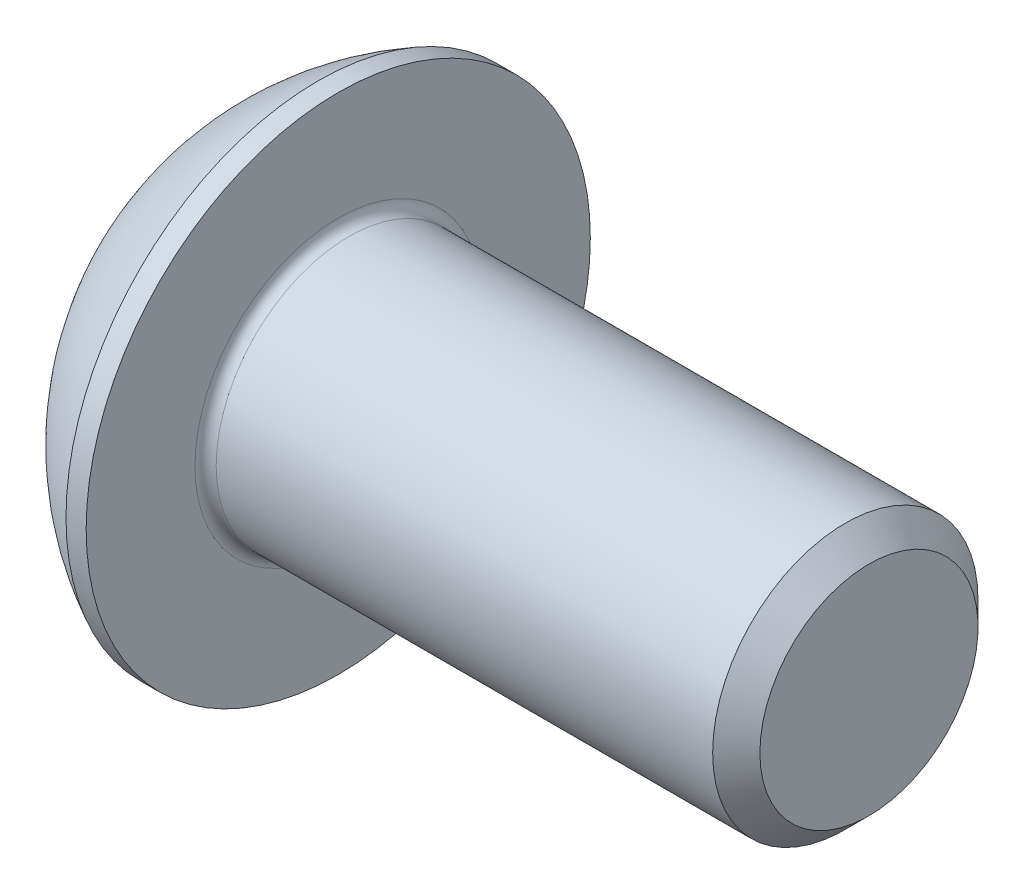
ISO-10303-21;
HEADER;
FILE_DESCRIPTION(('STEP AP214'),'2;1');
FILE_NAME('part.step','',(''),(''),'','','');
FILE_SCHEMA(('AUTOMOTIVE_DESIGN { 1 0 10303 214 1 1 1 1 }'));
ENDSEC;
DATA;
#1=APPLICATION_CONTEXT('core data for automotive mechanical design processes');
#2=APPLICATION_PROTOCOL_DEFINITION('international standard','automotive_design',2000,#1);
#3=PRODUCT_CONTEXT('',#1,'mechanical');
#4=PRODUCT('Part','Part','',(#3));
#5=PRODUCT_RELATED_PRODUCT_CATEGORY('part','',(#4));
#6=PRODUCT_DEFINITION_FORMATION('','',#4);
#7=PRODUCT_DEFINITION_CONTEXT('part definition',#1,'design');
#8=PRODUCT_DEFINITION('design','',#6,#7);
#9=PRODUCT_DEFINITION_SHAPE('','',#8);
#10=(LENGTH_UNIT() NAMED_UNIT(*) SI_UNIT(.MILLI.,.METRE.));
#11=(NAMED_UNIT(*) PLANE_ANGLE_UNIT() SI_UNIT($,.RADIAN.));
#12=(NAMED_UNIT(*) SI_UNIT($,.STERADIAN.) SOLID_ANGLE_UNIT());
#13=UNCERTAINTY_MEASURE_WITH_UNIT(LENGTH_MEASURE(1.E-05),#10,'distance_accuracy_value','');
#14=(GEOMETRIC_REPRESENTATION_CONTEXT(3) GLOBAL_UNCERTAINTY_ASSIGNED_CONTEXT((#13)) GLOBAL_UNIT_ASSIGNED_CONTEXT((#10,
#11,#12)) REPRESENTATION_CONTEXT('',''));
#15=CARTESIAN_POINT('',(0.,0.,0.));
#16=DIRECTION('',(0.,0.,1.));
#17=DIRECTION('',(1.,0.,0.));
#18=AXIS2_PLACEMENT_3D('',#15,#16,#17);
#19=CARTESIAN_POINT('',(0.,0.,0.));
#20=DIRECTION('',(-1.,0.,0.));
#21=DIRECTION('',(0.,0.,1.));
#22=AXIS2_PLACEMENT_3D('',#19,#20,#21);
#23=PLANE('',#22);
#24=CARTESIAN_POINT('',(0.,0.,0.));
#25=DIRECTION('',(-1.,0.,0.));
#26=DIRECTION('',(0.,0.,1.));
#27=AXIS2_PLACEMENT_3D('',#24,#25,#26);
#28=CIRCLE('',#27,2.375);
#29=CARTESIAN_POINT('',(0.,2.375,0.));
#30=VERTEX_POINT('',#29);
#31=EDGE_CURVE('E156',#30,#30,#28,.T.);
#32=ORIENTED_EDGE('',*,*,#31,.T.);
#33=EDGE_LOOP('',(#32));
#34=FACE_BOUND('',#33,.T.);
#35=DIRECTION('',(0.,-1.,0.));
#36=VECTOR('',#35,1.);
#37=CARTESIAN_POINT('',(0.,-0.866025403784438,1.5));
#38=LINE('',#37,#36);
#39=CARTESIAN_POINT('',(0.,0.86602540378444,1.5));
#40=VERTEX_POINT('',#39);
#41=CARTESIAN_POINT('',(0.,-0.866025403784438,1.5));
#42=VERTEX_POINT('',#41);
#43=EDGE_CURVE('E51',#40,#42,#38,.T.);
#44=ORIENTED_EDGE('',*,*,#43,.T.);
#45=DIRECTION('',(0.,-0.5,-0.866025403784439));
#46=VECTOR('',#45,1.);
#47=CARTESIAN_POINT('',(0.,-1.73205080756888,0.));
#48=LINE('',#47,#46);
#49=CARTESIAN_POINT('',(0.,-1.73205080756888,0.));
#50=VERTEX_POINT('',#49);
#51=EDGE_CURVE('E276',#42,#50,#48,.T.);
#52=ORIENTED_EDGE('',*,*,#51,.T.);
#53=DIRECTION('',(0.,0.5,-0.866025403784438));
#54=VECTOR('',#53,1.);
#55=CARTESIAN_POINT('',(0.,-0.866025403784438,-1.5));
#56=LINE('',#55,#54);
#57=CARTESIAN_POINT('',(0.,-0.866025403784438,-1.5));
#58=VERTEX_POINT('',#57);
#59=EDGE_CURVE('E131',#50,#58,#56,.T.);
#60=ORIENTED_EDGE('',*,*,#59,.T.);
#61=DIRECTION('',(0.,1.,0.));
#62=VECTOR('',#61,1.);
#63=CARTESIAN_POINT('',(0.,0.86602540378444,-1.5));
#64=LINE('',#63,#62);
#65=CARTESIAN_POINT('',(0.,0.86602540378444,-1.5));
#66=VERTEX_POINT('',#65);
#67=EDGE_CURVE('E279',#58,#66,#64,.T.);
#68=ORIENTED_EDGE('',*,*,#67,.T.);
#69=DIRECTION('',(0.,0.5,0.866025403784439));
#70=VECTOR('',#69,1.);
#71=CARTESIAN_POINT('',(0.,1.73205080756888,0.));
#72=LINE('',#71,#70);
#73=CARTESIAN_POINT('',(0.,1.73205080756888,0.));
#74=VERTEX_POINT('',#73);
#75=EDGE_CURVE('E281',#66,#74,#72,.T.);
#76=ORIENTED_EDGE('',*,*,#75,.T.);
#77=DIRECTION('',(0.,-0.5,0.866025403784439));
#78=VECTOR('',#77,1.);
#79=CARTESIAN_POINT('',(0.,0.86602540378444,1.5));
#80=LINE('',#79,#78);
#81=EDGE_CURVE('E283',#74,#40,#80,.T.);
#82=ORIENTED_EDGE('',*,*,#81,.T.);
#83=EDGE_LOOP('',(#44,#52,#60,#68,#76,#82));
#84=FACE_BOUND('',#83,.T.);
#85=ADVANCED_FACE('F36',(#34,#84),#23,.T.);
#86=CARTESIAN_POINT('',(4.75501582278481,0.,0.));
#87=DIRECTION('',(-1.,0.,0.));
#88=DIRECTION('',(0.,1.,0.));
#89=AXIS2_PLACEMENT_3D('',#86,#87,#88);
#90=SPHERICAL_SURFACE('',#89,5.3151482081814);
#91=CARTESIAN_POINT('',(2.37,0.,0.));
#92=DIRECTION('',(-1.,0.,0.));
#93=DIRECTION('',(0.,0.,1.));
#94=AXIS2_PLACEMENT_3D('',#91,#92,#93);
#95=CIRCLE('',#94,4.75);
#96=CARTESIAN_POINT('',(2.37,4.75,0.));
#97=VERTEX_POINT('',#96);
#98=EDGE_CURVE('E153',#97,#97,#95,.T.);
#99=CARTESIAN_POINT('',(2.37,4.75,0.));
#100=CARTESIAN_POINT('',(2.33822259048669,4.7340443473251,0.));
#101=CARTESIAN_POINT('',(2.30660534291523,4.71776971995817,0.));
#102=CARTESIAN_POINT('',(2.24370380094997,4.68458927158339,0.));
#103=CARTESIAN_POINT('',(2.21241950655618,4.66768345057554,0.));
#104=CARTESIAN_POINT('',(2.15019650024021,4.6332473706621,0.));
#105=CARTESIAN_POINT('',(2.11925778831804,4.6157171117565,0.));
#106=CARTESIAN_POINT('',(2.05773840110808,4.58003923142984,0.));
#107=CARTESIAN_POINT('',(2.02715772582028,4.56189161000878,0.));
#108=CARTESIAN_POINT('',(1.96636673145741,4.52498631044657,0.));
#109=CARTESIAN_POINT('',(1.93615641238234,4.50622863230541,0.));
#110=CARTESIAN_POINT('',(1.87611829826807,4.46811077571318,0.));
#111=CARTESIAN_POINT('',(1.84629050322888,4.4487505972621,0.));
#112=CARTESIAN_POINT('',(1.78702945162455,4.40943553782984,0.));
#113=CARTESIAN_POINT('',(1.75759619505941,4.38948065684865,0.));
#114=CARTESIAN_POINT('',(1.69913607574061,4.34898423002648,0.));
#115=CARTESIAN_POINT('',(1.67010921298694,4.32844268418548,0.));
#116=CARTESIAN_POINT('',(1.61247357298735,4.28678120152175,0.));
#117=CARTESIAN_POINT('',(1.58386479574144,4.265661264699,0.));
#118=CARTESIAN_POINT('',(1.52707685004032,4.22285150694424,0.));
#119=CARTESIAN_POINT('',(1.49889768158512,4.20116168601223,0.));
#120=CARTESIAN_POINT('',(1.44298030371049,4.15722089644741,0.));
#121=CARTESIAN_POINT('',(1.41524209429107,4.13496992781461,0.));
#122=CARTESIAN_POINT('',(1.36021780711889,4.08991580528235,0.));
#123=CARTESIAN_POINT('',(1.33293172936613,4.06711265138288,0.));
#124=CARTESIAN_POINT('',(1.278822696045,4.02096334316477,0.));
#125=CARTESIAN_POINT('',(1.25199974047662,3.99761718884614,0.));
#126=CARTESIAN_POINT('',(1.19882775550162,3.95039128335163,0.));
#127=CARTESIAN_POINT('',(1.172478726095,3.92651153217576,0.));
#128=CARTESIAN_POINT('',(1.1202652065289,3.87822805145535,0.));
#129=CARTESIAN_POINT('',(1.09440071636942,3.85382432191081,0.));
#130=CARTESIAN_POINT('',(1.04316669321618,3.8045027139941,0.));
#131=CARTESIAN_POINT('',(1.01779716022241,3.77958483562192,0.));
#132=CARTESIAN_POINT('',(0.9675632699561,3.72924496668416,0.));
#133=CARTESIAN_POINT('',(0.942698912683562,3.70382297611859,0.));
#134=CARTESIAN_POINT('',(0.89348538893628,3.65248512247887,0.));
#135=CARTESIAN_POINT('',(0.869136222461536,3.62656925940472,0.));
#136=CARTESIAN_POINT('',(0.82096288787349,3.57425409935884,0.));
#137=CARTESIAN_POINT('',(0.797138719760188,3.54785480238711,0.));
#138=CARTESIAN_POINT('',(0.750024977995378,3.49458340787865,0.));
#139=CARTESIAN_POINT('',(0.726735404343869,3.46771131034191,0.));
#140=CARTESIAN_POINT('',(0.680700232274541,3.41350513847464,0.));
#141=CARTESIAN_POINT('',(0.657954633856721,3.3861710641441,0.));
#142=CARTESIAN_POINT('',(0.613016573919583,3.33105194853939,0.));
#143=CARTESIAN_POINT('',(0.590824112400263,3.30326690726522,0.));
#144=CARTESIAN_POINT('',(0.547001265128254,3.24725704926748,0.));
#145=CARTESIAN_POINT('',(0.525370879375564,3.21903223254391,0.));
#146=CARTESIAN_POINT('',(0.48268089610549,3.16215419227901,0.));
#147=CARTESIAN_POINT('',(0.461621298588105,3.13350096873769,0.));
#148=CARTESIAN_POINT('',(0.420081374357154,3.07577765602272,0.));
#149=CARTESIAN_POINT('',(0.399601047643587,3.04670756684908,0.));
#150=CARTESIAN_POINT('',(0.359227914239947,2.98816223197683,0.));
#151=CARTESIAN_POINT('',(0.339335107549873,2.95868698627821,0.));
#152=CARTESIAN_POINT('',(0.300145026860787,2.89934321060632,0.));
#153=CARTESIAN_POINT('',(0.280847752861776,2.86947468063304,0.));
#154=CARTESIAN_POINT('',(0.242856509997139,2.80935636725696,0.));
#155=CARTESIAN_POINT('',(0.224162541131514,2.77910658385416,0.));
#156=CARTESIAN_POINT('',(0.187385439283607,2.71823794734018,0.));
#157=CARTESIAN_POINT('',(0.169302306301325,2.68761909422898,0.));
#158=CARTESIAN_POINT('',(0.133754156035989,2.626024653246,0.));
#159=CARTESIAN_POINT('',(0.116289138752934,2.59504906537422,0.));
#160=CARTESIAN_POINT('',(0.081984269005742,2.53275362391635,0.));
#161=CARTESIAN_POINT('',(0.0651444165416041,2.50143377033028,0.));
#162=CARTESIAN_POINT('',(0.03209660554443,2.43846244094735,0.));
#163=CARTESIAN_POINT('',(0.0158886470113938,2.40681096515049,0.));
#164=CARTESIAN_POINT('',(0.,2.375,0.));
#165=B_SPLINE_CURVE_WITH_KNOTS('',3,(#99,#100,#101,#102,#103,#104,#105,#106,#107,#108,#109,#110,
#111,#112,#113,#114,#115,#116,#117,#118,#119,#120,#121,#122,#123,#124,#125,#126,#127,#128,#129,
#130,#131,#132,#133,#134,#135,#136,#137,#138,#139,#140,#141,#142,#143,#144,#145,#146,#147,#148,
#149,#150,#151,#152,#153,#154,#155,#156,#157,#158,#159,#160,#161,#162,#163,#164),.UNSPECIFIED.,
.F.,.F.,(4,2,2,2,2,2,2,2,2,2,2,2,2,2,2,2,2,2,2,2,2,2,2,2,2,2,2,2,2,2,2,2,4),(0.,
0.106672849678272,0.213345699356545,0.320018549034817,0.426691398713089,0.533364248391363,
0.640037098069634,0.746709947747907,0.853382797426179,0.960055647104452,1.06672849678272,
1.173401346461,1.28007419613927,1.38674704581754,1.49341989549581,1.60009274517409,
1.70676559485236,1.81343844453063,1.9201112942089,2.02678414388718,2.13345699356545,
2.24012984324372,2.34680269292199,2.45347554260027,2.56014839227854,2.66682124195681,
2.77349409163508,2.88016694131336,2.98683979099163,3.0935126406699,3.20018549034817,
3.30685834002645,3.41353118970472),.UNSPECIFIED.);
#166=EDGE_CURVE('BSEAM177',#97,#30,#165,.T.);
#167=ORIENTED_EDGE('',*,*,#98,.T.);
#168=ORIENTED_EDGE('',*,*,#31,.F.);
#169=ORIENTED_EDGE('',*,*,#166,.T.);
#170=ORIENTED_EDGE('',*,*,#166,.F.);
#171=EDGE_LOOP('',(#167,#169,#168,#170));
#172=FACE_BOUND('',#171,.T.);
#173=ADVANCED_FACE('F177',(#172),#90,.T.);
#174=CARTESIAN_POINT('',(0.,0.,0.));
#175=DIRECTION('',(-1.,0.,0.));
#176=DIRECTION('',(0.,0.,1.));
#177=AXIS2_PLACEMENT_3D('',#174,#175,#176);
#178=CYLINDRICAL_SURFACE('',#177,4.75);
#179=ORIENTED_EDGE('',*,*,#98,.F.);
#180=EDGE_LOOP('',(#179));
#181=FACE_BOUND('',#180,.T.);
#182=CARTESIAN_POINT('',(2.75,0.,0.));
#183=DIRECTION('',(-1.,0.,0.));
#184=DIRECTION('',(0.,0.,1.));
#185=AXIS2_PLACEMENT_3D('',#182,#183,#184);
#186=CIRCLE('',#185,4.75);
#187=CARTESIAN_POINT('',(2.75,0.,4.75));
#188=VERTEX_POINT('',#187);
#189=EDGE_CURVE('E150',#188,#188,#186,.T.);
#190=ORIENTED_EDGE('',*,*,#189,.T.);
#191=EDGE_LOOP('',(#190));
#192=FACE_BOUND('',#191,.T.);
#193=ADVANCED_FACE('F182',(#181,#192),#178,.T.);
#194=CARTESIAN_POINT('',(2.75,2.49999999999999,0.));
#195=DIRECTION('',(-1.,0.,0.));
#196=DIRECTION('',(0.,0.,1.));
#197=AXIS2_PLACEMENT_3D('',#194,#195,#196);
#198=PLANE('',#197);
#199=CARTESIAN_POINT('',(2.75,0.,0.));
#200=DIRECTION('',(-1.,0.,0.));
#201=DIRECTION('',(0.,0.,1.));
#202=AXIS2_PLACEMENT_3D('',#199,#200,#201);
#203=CIRCLE('',#202,2.7);
#204=CARTESIAN_POINT('',(2.75,0.,2.7));
#205=VERTEX_POINT('',#204);
#206=EDGE_CURVE('E44',#205,#205,#203,.T.);
#207=ORIENTED_EDGE('',*,*,#206,.T.);
#208=EDGE_LOOP('',(#207));
#209=FACE_BOUND('',#208,.T.);
#210=ORIENTED_EDGE('',*,*,#189,.F.);
#211=EDGE_LOOP('',(#210));
#212=FACE_BOUND('',#211,.T.);
#213=ADVANCED_FACE('F161',(#209,#212),#198,.F.);
#214=CARTESIAN_POINT('',(0.,0.,0.));
#215=DIRECTION('',(-1.,0.,0.));
#216=DIRECTION('',(0.,0.,1.));
#217=AXIS2_PLACEMENT_3D('',#214,#215,#216);
#218=CYLINDRICAL_SURFACE('',#217,2.5);
#219=CARTESIAN_POINT('',(2.95,0.,0.));
#220=DIRECTION('',(-1.,0.,0.));
#221=DIRECTION('',(0.,0.,1.));
#222=AXIS2_PLACEMENT_3D('',#219,#220,#221);
#223=CIRCLE('',#222,2.5);
#224=CARTESIAN_POINT('',(2.95,0.,2.5));
#225=VERTEX_POINT('',#224);
#226=EDGE_CURVE('E11',#225,#225,#223,.F.);
#227=ORIENTED_EDGE('',*,*,#226,.T.);
#228=EDGE_LOOP('',(#227));
#229=FACE_BOUND('',#228,.T.);
#230=CARTESIAN_POINT('',(12.305,0.,0.));
#231=DIRECTION('',(-1.,0.,0.));
#232=DIRECTION('',(0.,0.,1.));
#233=AXIS2_PLACEMENT_3D('',#230,#231,#232);
#234=CIRCLE('',#233,2.5);
#235=CARTESIAN_POINT('',(12.305,0.,2.5));
#236=VERTEX_POINT('',#235);
#237=EDGE_CURVE('E147',#236,#236,#234,.T.);
#238=ORIENTED_EDGE('',*,*,#237,.T.);
#239=EDGE_LOOP('',(#238));
#240=FACE_BOUND('',#239,.T.);
#241=ADVANCED_FACE('F191',(#229,#240),#218,.T.);
#242=CARTESIAN_POINT('',(12.75,0.,0.));
#243=DIRECTION('',(-1.,0.,0.));
#244=DIRECTION('',(0.,0.,1.));
#245=AXIS2_PLACEMENT_3D('',#242,#243,#244);
#246=CONICAL_SURFACE('',#245,2.055,0.785398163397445);
#247=ORIENTED_EDGE('',*,*,#237,.F.);
#248=EDGE_LOOP('',(#247));
#249=FACE_BOUND('',#248,.T.);
#250=CARTESIAN_POINT('',(12.75,0.,0.));
#251=DIRECTION('',(-1.,0.,0.));
#252=DIRECTION('',(0.,0.,1.));
#253=AXIS2_PLACEMENT_3D('',#250,#251,#252);
#254=CIRCLE('',#253,2.055);
#255=CARTESIAN_POINT('',(12.75,0.,2.055));
#256=VERTEX_POINT('',#255);
#257=EDGE_CURVE('E143',#256,#256,#254,.T.);
#258=ORIENTED_EDGE('',*,*,#257,.T.);
#259=EDGE_LOOP('',(#258));
#260=FACE_BOUND('',#259,.T.);
#261=ADVANCED_FACE('F172',(#249,#260),#246,.T.);
#262=CARTESIAN_POINT('',(12.75,0.,0.));
#263=DIRECTION('',(-1.,0.,0.));
#264=DIRECTION('',(0.,0.,1.));
#265=AXIS2_PLACEMENT_3D('',#262,#263,#264);
#266=PLANE('',#265);
#267=ORIENTED_EDGE('',*,*,#257,.F.);
#268=EDGE_LOOP('',(#267));
#269=FACE_BOUND('',#268,.T.);
#270=ADVANCED_FACE('F165',(#269),#266,.F.);
#271=CARTESIAN_POINT('',(2.95,0.,0.));
#272=DIRECTION('',(-1.,0.,0.));
#273=DIRECTION('',(0.,0.,1.));
#274=AXIS2_PLACEMENT_3D('',#271,#272,#273);
#275=TOROIDAL_SURFACE('',#274,2.7,0.2);
#276=ORIENTED_EDGE('',*,*,#226,.F.);
#277=EDGE_LOOP('',(#276));
#278=FACE_BOUND('',#277,.T.);
#279=ORIENTED_EDGE('',*,*,#206,.F.);
#280=EDGE_LOOP('',(#279));
#281=FACE_BOUND('',#280,.T.);
#282=ADVANCED_FACE('F38',(#278,#281),#275,.F.);
#283=CARTESIAN_POINT('',(1.56,-1.73205080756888,0.));
#284=DIRECTION('',(0.,0.866025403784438,-0.5));
#285=DIRECTION('',(0.,0.5,0.866025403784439));
#286=AXIS2_PLACEMENT_3D('',#283,#284,#285);
#287=PLANE('',#286);
#288=DIRECTION('',(0.,-0.5,-0.866025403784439));
#289=VECTOR('',#288,1.);
#290=CARTESIAN_POINT('',(1.56,-1.73205080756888,0.));
#291=LINE('',#290,#289);
#292=CARTESIAN_POINT('',(1.56,-0.866025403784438,1.5));
#293=VERTEX_POINT('',#292);
#294=CARTESIAN_POINT('',(1.56,-1.29903810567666,0.75));
#295=VERTEX_POINT('',#294);
#296=EDGE_CURVE('E117',#293,#295,#291,.T.);
#297=ORIENTED_EDGE('',*,*,#296,.T.);
#298=CARTESIAN_POINT('',(1.56,-1.73205080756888,0.));
#299=VERTEX_POINT('',#298);
#300=EDGE_CURVE('E112',#295,#299,#291,.T.);
#301=ORIENTED_EDGE('',*,*,#300,.T.);
#302=DIRECTION('',(-1.,0.,0.));
#303=VECTOR('',#302,1.);
#304=CARTESIAN_POINT('',(1.56,-1.73205080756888,0.));
#305=LINE('',#304,#303);
#306=EDGE_CURVE('E114',#299,#50,#305,.T.);
#307=ORIENTED_EDGE('',*,*,#306,.T.);
#308=ORIENTED_EDGE('',*,*,#51,.F.);
#309=DIRECTION('',(-1.,0.,0.));
#310=VECTOR('',#309,1.);
#311=CARTESIAN_POINT('',(1.56,-0.866025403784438,1.5));
#312=LINE('',#311,#310);
#313=EDGE_CURVE('E272',#293,#42,#312,.T.);
#314=ORIENTED_EDGE('',*,*,#313,.F.);
#315=EDGE_LOOP('',(#297,#301,#307,#308,#314));
#316=FACE_BOUND('',#315,.T.);
#317=ADVANCED_FACE('F113',(#316),#287,.T.);
#318=CARTESIAN_POINT('',(1.56,-0.866025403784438,-1.5));
#319=DIRECTION('',(0.,0.866025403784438,0.5));
#320=DIRECTION('',(0.,-0.5,0.866025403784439));
#321=AXIS2_PLACEMENT_3D('',#318,#319,#320);
#322=PLANE('',#321);
#323=DIRECTION('',(0.,0.5,-0.866025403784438));
#324=VECTOR('',#323,1.);
#325=CARTESIAN_POINT('',(1.56,-0.866025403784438,-1.5));
#326=LINE('',#325,#324);
#327=CARTESIAN_POINT('',(1.56,-1.29903810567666,-0.75));
#328=VERTEX_POINT('',#327);
#329=EDGE_CURVE('E59',#299,#328,#326,.T.);
#330=ORIENTED_EDGE('',*,*,#329,.T.);
#331=CARTESIAN_POINT('',(1.56,-0.866025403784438,-1.5));
#332=VERTEX_POINT('',#331);
#333=EDGE_CURVE('E126',#328,#332,#326,.T.);
#334=ORIENTED_EDGE('',*,*,#333,.T.);
#335=DIRECTION('',(-1.,0.,0.));
#336=VECTOR('',#335,1.);
#337=CARTESIAN_POINT('',(1.56,-0.866025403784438,-1.5));
#338=LINE('',#337,#336);
#339=EDGE_CURVE('E133',#332,#58,#338,.T.);
#340=ORIENTED_EDGE('',*,*,#339,.T.);
#341=ORIENTED_EDGE('',*,*,#59,.F.);
#342=ORIENTED_EDGE('',*,*,#306,.F.);
#343=EDGE_LOOP('',(#330,#334,#340,#341,#342));
#344=FACE_BOUND('',#343,.T.);
#345=ADVANCED_FACE('F129',(#344),#322,.T.);
#346=CARTESIAN_POINT('',(1.56,0.86602540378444,-1.5));
#347=DIRECTION('',(0.,0.,1.));
#348=DIRECTION('',(0.,-1.,0.));
#349=AXIS2_PLACEMENT_3D('',#346,#347,#348);
#350=PLANE('',#349);
#351=DIRECTION('',(0.,1.,0.));
#352=VECTOR('',#351,1.);
#353=CARTESIAN_POINT('',(1.56,0.86602540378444,-1.5));
#354=LINE('',#353,#352);
#355=CARTESIAN_POINT('',(1.56,0.,-1.5));
#356=VERTEX_POINT('',#355);
#357=EDGE_CURVE('E253',#332,#356,#354,.T.);
#358=ORIENTED_EDGE('',*,*,#357,.T.);
#359=CARTESIAN_POINT('',(1.56,0.86602540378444,-1.5));
#360=VERTEX_POINT('',#359);
#361=EDGE_CURVE('E125',#356,#360,#354,.T.);
#362=ORIENTED_EDGE('',*,*,#361,.T.);
#363=DIRECTION('',(-1.,0.,0.));
#364=VECTOR('',#363,1.);
#365=CARTESIAN_POINT('',(1.56,0.86602540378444,-1.5));
#366=LINE('',#365,#364);
#367=EDGE_CURVE('E138',#360,#66,#366,.T.);
#368=ORIENTED_EDGE('',*,*,#367,.T.);
#369=ORIENTED_EDGE('',*,*,#67,.F.);
#370=ORIENTED_EDGE('',*,*,#339,.F.);
#371=EDGE_LOOP('',(#358,#362,#368,#369,#370));
#372=FACE_BOUND('',#371,.T.);
#373=ADVANCED_FACE('F205',(#372),#350,.T.);
#374=CARTESIAN_POINT('',(1.56,1.73205080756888,0.));
#375=DIRECTION('',(0.,-0.866025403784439,0.5));
#376=DIRECTION('',(0.,-0.5,-0.866025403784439));
#377=AXIS2_PLACEMENT_3D('',#374,#375,#376);
#378=PLANE('',#377);
#379=DIRECTION('',(0.,0.5,0.866025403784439));
#380=VECTOR('',#379,1.);
#381=CARTESIAN_POINT('',(1.56,1.73205080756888,0.));
#382=LINE('',#381,#380);
#383=CARTESIAN_POINT('',(1.56,1.29903810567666,-0.750000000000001));
#384=VERTEX_POINT('',#383);
#385=EDGE_CURVE('E242',#360,#384,#382,.T.);
#386=ORIENTED_EDGE('',*,*,#385,.T.);
#387=CARTESIAN_POINT('',(1.56,1.73205080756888,0.));
#388=VERTEX_POINT('',#387);
#389=EDGE_CURVE('E247',#384,#388,#382,.T.);
#390=ORIENTED_EDGE('',*,*,#389,.T.);
#391=DIRECTION('',(-1.,0.,0.));
#392=VECTOR('',#391,1.);
#393=CARTESIAN_POINT('',(1.56,1.73205080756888,0.));
#394=LINE('',#393,#392);
#395=EDGE_CURVE('E287',#388,#74,#394,.T.);
#396=ORIENTED_EDGE('',*,*,#395,.T.);
#397=ORIENTED_EDGE('',*,*,#75,.F.);
#398=ORIENTED_EDGE('',*,*,#367,.F.);
#399=EDGE_LOOP('',(#386,#390,#396,#397,#398));
#400=FACE_BOUND('',#399,.T.);
#401=ADVANCED_FACE('F208',(#400),#378,.T.);
#402=CARTESIAN_POINT('',(1.56,0.86602540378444,1.5));
#403=DIRECTION('',(0.,-0.866025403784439,-0.5));
#404=DIRECTION('',(0.,0.5,-0.866025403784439));
#405=AXIS2_PLACEMENT_3D('',#402,#403,#404);
#406=PLANE('',#405);
#407=DIRECTION('',(0.,-0.5,0.866025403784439));
#408=VECTOR('',#407,1.);
#409=CARTESIAN_POINT('',(1.56,0.86602540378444,1.5));
#410=LINE('',#409,#408);
#411=CARTESIAN_POINT('',(1.56,1.29903810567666,0.75));
#412=VERTEX_POINT('',#411);
#413=EDGE_CURVE('E250',#388,#412,#410,.T.);
#414=ORIENTED_EDGE('',*,*,#413,.T.);
#415=CARTESIAN_POINT('',(1.56,0.86602540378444,1.5));
#416=VERTEX_POINT('',#415);
#417=EDGE_CURVE('E258',#412,#416,#410,.T.);
#418=ORIENTED_EDGE('',*,*,#417,.T.);
#419=DIRECTION('',(-1.,0.,0.));
#420=VECTOR('',#419,1.);
#421=CARTESIAN_POINT('',(1.56,0.86602540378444,1.5));
#422=LINE('',#421,#420);
#423=EDGE_CURVE('E271',#416,#40,#422,.T.);
#424=ORIENTED_EDGE('',*,*,#423,.T.);
#425=ORIENTED_EDGE('',*,*,#81,.F.);
#426=ORIENTED_EDGE('',*,*,#395,.F.);
#427=EDGE_LOOP('',(#414,#418,#424,#425,#426));
#428=FACE_BOUND('',#427,.T.);
#429=ADVANCED_FACE('F212',(#428),#406,.T.);
#430=CARTESIAN_POINT('',(1.56,-0.866025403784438,1.5));
#431=DIRECTION('',(0.,0.,-1.));
#432=DIRECTION('',(0.,1.,0.));
#433=AXIS2_PLACEMENT_3D('',#430,#431,#432);
#434=PLANE('',#433);
#435=DIRECTION('',(0.,-1.,0.));
#436=VECTOR('',#435,1.);
#437=CARTESIAN_POINT('',(1.56,-0.866025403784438,1.5));
#438=LINE('',#437,#436);
#439=CARTESIAN_POINT('',(1.56,0.,1.5));
#440=VERTEX_POINT('',#439);
#441=EDGE_CURVE('E264',#416,#440,#438,.T.);
#442=ORIENTED_EDGE('',*,*,#441,.T.);
#443=EDGE_CURVE('E266',#440,#293,#438,.T.);
#444=ORIENTED_EDGE('',*,*,#443,.T.);
#445=ORIENTED_EDGE('',*,*,#313,.T.);
#446=ORIENTED_EDGE('',*,*,#43,.F.);
#447=ORIENTED_EDGE('',*,*,#423,.F.);
#448=EDGE_LOOP('',(#442,#444,#445,#446,#447));
#449=FACE_BOUND('',#448,.T.);
#450=ADVANCED_FACE('F216',(#449),#434,.T.);
#451=CARTESIAN_POINT('',(1.56,-1.73205080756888,0.));
#452=DIRECTION('',(1.,0.,0.));
#453=DIRECTION('',(0.,0.,-1.));
#454=AXIS2_PLACEMENT_3D('',#451,#452,#453);
#455=PLANE('',#454);
#456=CARTESIAN_POINT('',(1.56,0.,0.));
#457=DIRECTION('',(-1.,0.,0.));
#458=DIRECTION('',(0.,0.,1.));
#459=AXIS2_PLACEMENT_3D('',#456,#457,#458);
#460=CIRCLE('',#459,1.5);
#461=EDGE_CURVE('E239',#384,#356,#460,.T.);
#462=ORIENTED_EDGE('',*,*,#461,.F.);
#463=ORIENTED_EDGE('',*,*,#385,.F.);
#464=ORIENTED_EDGE('',*,*,#361,.F.);
#465=EDGE_LOOP('',(#462,#463,#464));
#466=FACE_BOUND('',#465,.T.);
#467=ADVANCED_FACE('F220',(#466),#455,.F.);
#468=EDGE_CURVE('E144',#412,#384,#460,.T.);
#469=ORIENTED_EDGE('',*,*,#468,.F.);
#470=ORIENTED_EDGE('',*,*,#413,.F.);
#471=ORIENTED_EDGE('',*,*,#389,.F.);
#472=EDGE_LOOP('',(#469,#470,#471));
#473=FACE_BOUND('',#472,.T.);
#474=ADVANCED_FACE('F229',(#473),#455,.F.);
#475=EDGE_CURVE('E137',#440,#412,#460,.T.);
#476=ORIENTED_EDGE('',*,*,#475,.F.);
#477=ORIENTED_EDGE('',*,*,#441,.F.);
#478=ORIENTED_EDGE('',*,*,#417,.F.);
#479=EDGE_LOOP('',(#476,#477,#478));
#480=FACE_BOUND('',#479,.T.);
#481=ADVANCED_FACE('F234',(#480),#455,.F.);
#482=EDGE_CURVE('E132',#295,#440,#460,.T.);
#483=ORIENTED_EDGE('',*,*,#482,.F.);
#484=ORIENTED_EDGE('',*,*,#296,.F.);
#485=ORIENTED_EDGE('',*,*,#443,.F.);
#486=EDGE_LOOP('',(#483,#484,#485));
#487=FACE_BOUND('',#486,.T.);
#488=ADVANCED_FACE('F227',(#487),#455,.F.);
#489=EDGE_CURVE('E123',#328,#295,#460,.T.);
#490=ORIENTED_EDGE('',*,*,#489,.F.);
#491=ORIENTED_EDGE('',*,*,#329,.F.);
#492=ORIENTED_EDGE('',*,*,#300,.F.);
#493=EDGE_LOOP('',(#490,#491,#492));
#494=FACE_BOUND('',#493,.T.);
#495=ADVANCED_FACE('F122',(#494),#455,.F.);
#496=EDGE_CURVE('E245',#356,#328,#460,.T.);
#497=ORIENTED_EDGE('',*,*,#496,.F.);
#498=ORIENTED_EDGE('',*,*,#357,.F.);
#499=ORIENTED_EDGE('',*,*,#333,.F.);
#500=EDGE_LOOP('',(#497,#498,#499));
#501=FACE_BOUND('',#500,.T.);
#502=ADVANCED_FACE('F200',(#501),#455,.F.);
#503=CARTESIAN_POINT('',(2.42602540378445,0.,0.));
#504=DIRECTION('',(-1.,0.,0.));
#505=DIRECTION('',(0.,0.,1.));
#506=AXIS2_PLACEMENT_3D('',#503,#504,#505);
#507=CONICAL_SURFACE('',#506,0.,1.04719755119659);
#508=ORIENTED_EDGE('',*,*,#475,.T.);
#509=ORIENTED_EDGE('',*,*,#468,.T.);
#510=ORIENTED_EDGE('',*,*,#461,.T.);
#511=ORIENTED_EDGE('',*,*,#496,.T.);
#512=ORIENTED_EDGE('',*,*,#489,.T.);
#513=ORIENTED_EDGE('',*,*,#482,.T.);
#514=EDGE_LOOP('',(#508,#509,#510,#511,#512,#513));
#515=FACE_BOUND('',#514,.T.);
#516=CARTESIAN_POINT('',(2.42602540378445,0.,0.));
#517=VERTEX_POINT('',#516);
#518=VERTEX_LOOP('',#517);
#519=FACE_BOUND('',#518,.T.);
#520=ADVANCED_FACE('F198',(#515,#519),#507,.F.);
#521=CLOSED_SHELL('',(#85,#173,#193,#213,#241,#261,#270,#282,#317,#345,#373,#401,#429,#450,#467,
#474,#481,#488,#495,#502,#520));
#522=MANIFOLD_SOLID_BREP('B2',#521);
#523=ADVANCED_BREP_SHAPE_REPRESENTATION('',(#18,#522),#14);
#524=SHAPE_DEFINITION_REPRESENTATION(#9,#523);
ENDSEC;
END-ISO-10303-21;
